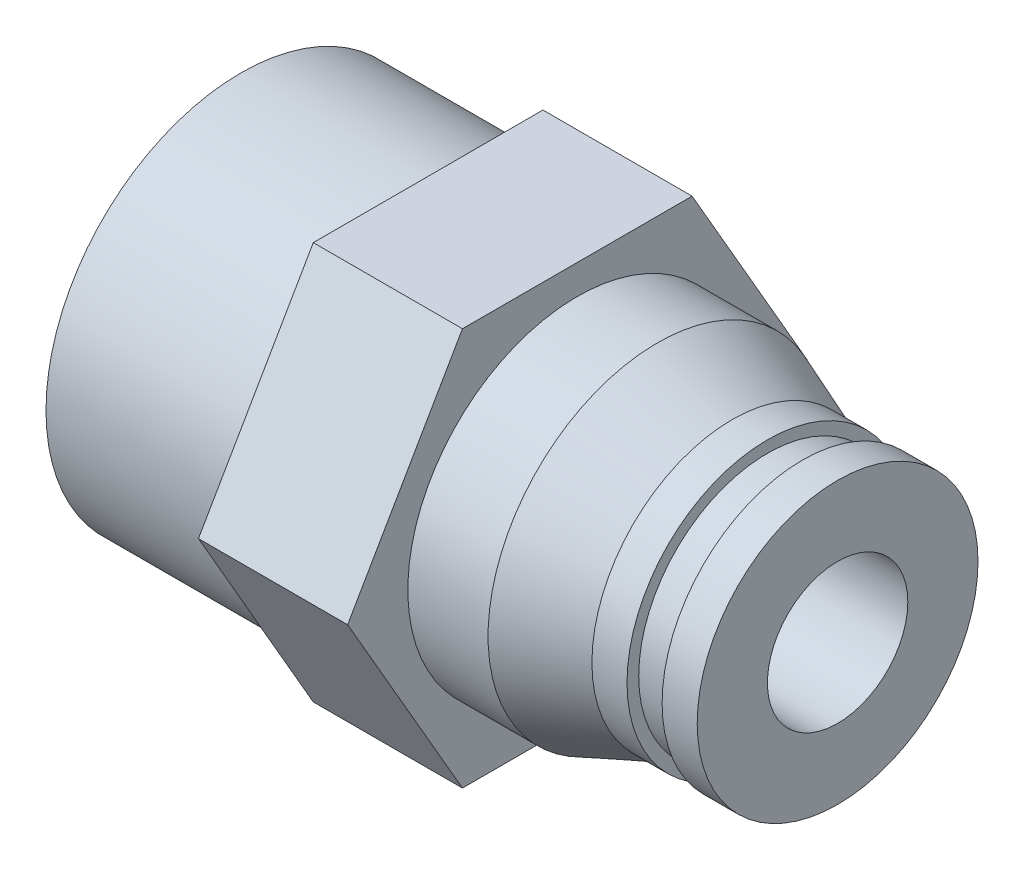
ISO-10303-21;
HEADER;
FILE_DESCRIPTION(('STEP AP214'),'2;1');
FILE_NAME('part.step','',(''),(''),'','','');
FILE_SCHEMA(('AUTOMOTIVE_DESIGN { 1 0 10303 214 1 1 1 1 }'));
ENDSEC;
DATA;
#1=APPLICATION_CONTEXT('core data for automotive mechanical design processes');
#2=APPLICATION_PROTOCOL_DEFINITION('international standard','automotive_design',2000,#1);
#3=PRODUCT_CONTEXT('',#1,'mechanical');
#4=PRODUCT('Part','Part','',(#3));
#5=PRODUCT_RELATED_PRODUCT_CATEGORY('part','',(#4));
#6=PRODUCT_DEFINITION_FORMATION('','',#4);
#7=PRODUCT_DEFINITION_CONTEXT('part definition',#1,'design');
#8=PRODUCT_DEFINITION('design','',#6,#7);
#9=PRODUCT_DEFINITION_SHAPE('','',#8);
#10=(LENGTH_UNIT() NAMED_UNIT(*) SI_UNIT(.MILLI.,.METRE.));
#11=(NAMED_UNIT(*) PLANE_ANGLE_UNIT() SI_UNIT($,.RADIAN.));
#12=(NAMED_UNIT(*) SI_UNIT($,.STERADIAN.) SOLID_ANGLE_UNIT());
#13=UNCERTAINTY_MEASURE_WITH_UNIT(LENGTH_MEASURE(1.E-05),#10,'distance_accuracy_value','');
#14=(GEOMETRIC_REPRESENTATION_CONTEXT(3) GLOBAL_UNCERTAINTY_ASSIGNED_CONTEXT((#13)) GLOBAL_UNIT_ASSIGNED_CONTEXT((#10,
#11,#12)) REPRESENTATION_CONTEXT('',''));
#15=CARTESIAN_POINT('',(0.,0.,0.));
#16=DIRECTION('',(0.,0.,1.));
#17=DIRECTION('',(1.,0.,0.));
#18=AXIS2_PLACEMENT_3D('',#15,#16,#17);
#19=CARTESIAN_POINT('',(8.,8.33,0.));
#20=DIRECTION('',(-1.,0.,0.));
#21=DIRECTION('',(0.,0.,1.));
#22=AXIS2_PLACEMENT_3D('',#19,#20,#21);
#23=PLANE('',#22);
#24=CARTESIAN_POINT('',(8.,0.,0.));
#25=DIRECTION('',(1.,0.,0.));
#26=DIRECTION('',(0.,0.,-1.));
#27=AXIS2_PLACEMENT_3D('',#24,#25,#26);
#28=CIRCLE('',#27,8.33);
#29=CARTESIAN_POINT('',(8.,0.,-8.33));
#30=VERTEX_POINT('',#29);
#31=EDGE_CURVE('E215',#30,#30,#28,.T.);
#32=ORIENTED_EDGE('',*,*,#31,.T.);
#33=EDGE_LOOP('',(#32));
#34=FACE_BOUND('',#33,.T.);
#35=DIRECTION('',(0.,-0.866025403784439,0.5));
#36=VECTOR('',#35,1.);
#37=CARTESIAN_POINT('',(8.,0.,-9.81495457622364));
#38=LINE('',#37,#36);
#39=CARTESIAN_POINT('',(8.,0.,-9.81495457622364));
#40=VERTEX_POINT('',#39);
#41=CARTESIAN_POINT('',(8.,-8.5,-4.90747728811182));
#42=VERTEX_POINT('',#41);
#43=EDGE_CURVE('E121',#40,#42,#38,.T.);
#44=ORIENTED_EDGE('',*,*,#43,.T.);
#45=DIRECTION('',(0.,0.,1.));
#46=VECTOR('',#45,1.);
#47=CARTESIAN_POINT('',(8.,-8.5,-4.90747728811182));
#48=LINE('',#47,#46);
#49=CARTESIAN_POINT('',(8.,-8.5,4.90747728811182));
#50=VERTEX_POINT('',#49);
#51=EDGE_CURVE('E106',#42,#50,#48,.T.);
#52=ORIENTED_EDGE('',*,*,#51,.T.);
#53=DIRECTION('',(0.,0.866025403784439,0.5));
#54=VECTOR('',#53,1.);
#55=CARTESIAN_POINT('',(8.,-8.5,4.90747728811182));
#56=LINE('',#55,#54);
#57=CARTESIAN_POINT('',(8.,0.,9.81495457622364));
#58=VERTEX_POINT('',#57);
#59=EDGE_CURVE('E115',#50,#58,#56,.T.);
#60=ORIENTED_EDGE('',*,*,#59,.T.);
#61=DIRECTION('',(0.,0.866025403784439,-0.5));
#62=VECTOR('',#61,1.);
#63=CARTESIAN_POINT('',(8.,0.,9.81495457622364));
#64=LINE('',#63,#62);
#65=CARTESIAN_POINT('',(8.,8.5,4.90747728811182));
#66=VERTEX_POINT('',#65);
#67=EDGE_CURVE('E30',#58,#66,#64,.T.);
#68=ORIENTED_EDGE('',*,*,#67,.T.);
#69=DIRECTION('',(0.,0.,-1.));
#70=VECTOR('',#69,1.);
#71=CARTESIAN_POINT('',(8.,8.5,4.90747728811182));
#72=LINE('',#71,#70);
#73=CARTESIAN_POINT('',(8.,8.5,-4.90747728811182));
#74=VERTEX_POINT('',#73);
#75=EDGE_CURVE('E125',#66,#74,#72,.T.);
#76=ORIENTED_EDGE('',*,*,#75,.T.);
#77=DIRECTION('',(0.,-0.866025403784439,-0.5));
#78=VECTOR('',#77,1.);
#79=CARTESIAN_POINT('',(8.,8.5,-4.90747728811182));
#80=LINE('',#79,#78);
#81=EDGE_CURVE('E128',#74,#40,#80,.T.);
#82=ORIENTED_EDGE('',*,*,#81,.T.);
#83=EDGE_LOOP('',(#44,#52,#60,#68,#76,#82));
#84=FACE_BOUND('',#83,.T.);
#85=ADVANCED_FACE('F15',(#34,#84),#23,.T.);
#86=CARTESIAN_POINT('',(14.375,10.5,0.));
#87=DIRECTION('',(1.,0.,0.));
#88=DIRECTION('',(0.,0.,-1.));
#89=AXIS2_PLACEMENT_3D('',#86,#87,#88);
#90=PLANE('',#89);
#91=CARTESIAN_POINT('',(14.375,0.,0.));
#92=DIRECTION('',(1.,0.,0.));
#93=DIRECTION('',(0.,0.,-1.));
#94=AXIS2_PLACEMENT_3D('',#91,#92,#93);
#95=CIRCLE('',#94,7.24152932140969);
#96=CARTESIAN_POINT('',(14.375,0.,-7.24152932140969));
#97=VERTEX_POINT('',#96);
#98=EDGE_CURVE('E212',#97,#97,#95,.T.);
#99=ORIENTED_EDGE('',*,*,#98,.F.);
#100=EDGE_LOOP('',(#99));
#101=FACE_BOUND('',#100,.T.);
#102=DIRECTION('',(0.,0.866025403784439,0.5));
#103=VECTOR('',#102,1.);
#104=CARTESIAN_POINT('',(14.375,-8.5,4.90747728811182));
#105=LINE('',#104,#103);
#106=CARTESIAN_POINT('',(14.375,-8.5,4.90747728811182));
#107=VERTEX_POINT('',#106);
#108=CARTESIAN_POINT('',(14.375,0.,9.81495457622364));
#109=VERTEX_POINT('',#108);
#110=EDGE_CURVE('E132',#107,#109,#105,.T.);
#111=ORIENTED_EDGE('',*,*,#110,.F.);
#112=DIRECTION('',(0.,0.,1.));
#113=VECTOR('',#112,1.);
#114=CARTESIAN_POINT('',(14.375,-8.5,-4.90747728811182));
#115=LINE('',#114,#113);
#116=CARTESIAN_POINT('',(14.375,-8.5,-4.90747728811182));
#117=VERTEX_POINT('',#116);
#118=EDGE_CURVE('E38',#117,#107,#115,.T.);
#119=ORIENTED_EDGE('',*,*,#118,.F.);
#120=DIRECTION('',(0.,-0.866025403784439,0.5));
#121=VECTOR('',#120,1.);
#122=CARTESIAN_POINT('',(14.375,0.,-9.81495457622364));
#123=LINE('',#122,#121);
#124=CARTESIAN_POINT('',(14.375,0.,-9.81495457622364));
#125=VERTEX_POINT('',#124);
#126=EDGE_CURVE('E112',#125,#117,#123,.T.);
#127=ORIENTED_EDGE('',*,*,#126,.F.);
#128=DIRECTION('',(0.,-0.866025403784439,-0.5));
#129=VECTOR('',#128,1.);
#130=CARTESIAN_POINT('',(14.375,8.5,-4.90747728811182));
#131=LINE('',#130,#129);
#132=CARTESIAN_POINT('',(14.375,8.5,-4.90747728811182));
#133=VERTEX_POINT('',#132);
#134=EDGE_CURVE('E140',#133,#125,#131,.T.);
#135=ORIENTED_EDGE('',*,*,#134,.F.);
#136=DIRECTION('',(0.,0.,-1.));
#137=VECTOR('',#136,1.);
#138=CARTESIAN_POINT('',(14.375,8.5,4.90747728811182));
#139=LINE('',#138,#137);
#140=CARTESIAN_POINT('',(14.375,8.5,4.90747728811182));
#141=VERTEX_POINT('',#140);
#142=EDGE_CURVE('E137',#141,#133,#139,.T.);
#143=ORIENTED_EDGE('',*,*,#142,.F.);
#144=DIRECTION('',(0.,0.866025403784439,-0.5));
#145=VECTOR('',#144,1.);
#146=CARTESIAN_POINT('',(14.375,0.,9.81495457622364));
#147=LINE('',#146,#145);
#148=EDGE_CURVE('E134',#109,#141,#147,.T.);
#149=ORIENTED_EDGE('',*,*,#148,.F.);
#150=EDGE_LOOP('',(#111,#119,#127,#135,#143,#149));
#151=FACE_BOUND('',#150,.T.);
#152=ADVANCED_FACE('F269',(#101,#151),#90,.T.);
#153=CARTESIAN_POINT('',(0.,0.,0.));
#154=DIRECTION('',(-1.,0.,0.));
#155=DIRECTION('',(0.,0.,1.));
#156=AXIS2_PLACEMENT_3D('',#153,#154,#155);
#157=PLANE('',#156);
#158=CARTESIAN_POINT('',(0.,0.,0.));
#159=DIRECTION('',(1.,0.,0.));
#160=DIRECTION('',(0.,0.,-1.));
#161=AXIS2_PLACEMENT_3D('',#158,#159,#160);
#162=CIRCLE('',#161,8.33);
#163=CARTESIAN_POINT('',(0.,0.,-8.33));
#164=VERTEX_POINT('',#163);
#165=EDGE_CURVE('E218',#164,#164,#162,.T.);
#166=ORIENTED_EDGE('',*,*,#165,.F.);
#167=EDGE_LOOP('',(#166));
#168=FACE_BOUND('',#167,.T.);
#169=DIRECTION('',(0.,-0.866025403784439,-0.5));
#170=VECTOR('',#169,1.);
#171=CARTESIAN_POINT('',(0.,0.,2.88675134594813));
#172=LINE('',#171,#170);
#173=CARTESIAN_POINT('',(0.,0.,2.88675134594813));
#174=VERTEX_POINT('',#173);
#175=CARTESIAN_POINT('',(0.,-2.5,1.44337567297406));
#176=VERTEX_POINT('',#175);
#177=EDGE_CURVE('E169',#174,#176,#172,.T.);
#178=ORIENTED_EDGE('',*,*,#177,.T.);
#179=DIRECTION('',(0.,0.,-1.));
#180=VECTOR('',#179,1.);
#181=CARTESIAN_POINT('',(0.,-2.5,1.44337567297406));
#182=LINE('',#181,#180);
#183=CARTESIAN_POINT('',(0.,-2.5,-1.44337567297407));
#184=VERTEX_POINT('',#183);
#185=EDGE_CURVE('E147',#176,#184,#182,.T.);
#186=ORIENTED_EDGE('',*,*,#185,.T.);
#187=DIRECTION('',(0.,0.866025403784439,-0.5));
#188=VECTOR('',#187,1.);
#189=CARTESIAN_POINT('',(0.,-2.5,-1.44337567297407));
#190=LINE('',#189,#188);
#191=CARTESIAN_POINT('',(0.,0.,-2.88675134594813));
#192=VERTEX_POINT('',#191);
#193=EDGE_CURVE('E157',#184,#192,#190,.T.);
#194=ORIENTED_EDGE('',*,*,#193,.T.);
#195=DIRECTION('',(0.,0.866025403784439,0.5));
#196=VECTOR('',#195,1.);
#197=CARTESIAN_POINT('',(0.,0.,-2.88675134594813));
#198=LINE('',#197,#196);
#199=CARTESIAN_POINT('',(0.,2.5,-1.44337567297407));
#200=VERTEX_POINT('',#199);
#201=EDGE_CURVE('E160',#192,#200,#198,.T.);
#202=ORIENTED_EDGE('',*,*,#201,.T.);
#203=DIRECTION('',(0.,0.,1.));
#204=VECTOR('',#203,1.);
#205=CARTESIAN_POINT('',(0.,2.5,-1.44337567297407));
#206=LINE('',#205,#204);
#207=CARTESIAN_POINT('',(0.,2.5,1.44337567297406));
#208=VERTEX_POINT('',#207);
#209=EDGE_CURVE('E163',#200,#208,#206,.T.);
#210=ORIENTED_EDGE('',*,*,#209,.T.);
#211=DIRECTION('',(0.,-0.866025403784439,0.5));
#212=VECTOR('',#211,1.);
#213=CARTESIAN_POINT('',(0.,2.5,1.44337567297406));
#214=LINE('',#213,#212);
#215=EDGE_CURVE('E166',#208,#174,#214,.T.);
#216=ORIENTED_EDGE('',*,*,#215,.T.);
#217=EDGE_LOOP('',(#178,#186,#194,#202,#210,#216));
#218=FACE_BOUND('',#217,.T.);
#219=ADVANCED_FACE('F17',(#168,#218),#157,.T.);
#220=CARTESIAN_POINT('',(9.,3.,0.));
#221=DIRECTION('',(1.,0.,0.));
#222=DIRECTION('',(0.,0.,-1.));
#223=AXIS2_PLACEMENT_3D('',#220,#221,#222);
#224=PLANE('',#223);
#225=CARTESIAN_POINT('',(9.,0.,0.));
#226=DIRECTION('',(1.,0.,0.));
#227=DIRECTION('',(0.,0.,-1.));
#228=AXIS2_PLACEMENT_3D('',#225,#226,#227);
#229=CIRCLE('',#228,3.);
#230=CARTESIAN_POINT('',(9.,0.,-3.));
#231=VERTEX_POINT('',#230);
#232=EDGE_CURVE('E185',#231,#231,#229,.T.);
#233=ORIENTED_EDGE('',*,*,#232,.T.);
#234=EDGE_LOOP('',(#233));
#235=FACE_BOUND('',#234,.T.);
#236=DIRECTION('',(0.,-0.866025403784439,0.5));
#237=VECTOR('',#236,1.);
#238=CARTESIAN_POINT('',(9.,1.,-3.46410161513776));
#239=LINE('',#238,#237);
#240=CARTESIAN_POINT('',(9.,0.,-2.88675134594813));
#241=VERTEX_POINT('',#240);
#242=CARTESIAN_POINT('',(9.,-2.5,-1.44337567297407));
#243=VERTEX_POINT('',#242);
#244=EDGE_CURVE('E23',#241,#243,#239,.T.);
#245=ORIENTED_EDGE('',*,*,#244,.T.);
#246=DIRECTION('',(0.,0.,1.));
#247=VECTOR('',#246,1.);
#248=CARTESIAN_POINT('',(9.,-2.5,0.));
#249=LINE('',#248,#247);
#250=CARTESIAN_POINT('',(9.,-2.5,1.44337567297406));
#251=VERTEX_POINT('',#250);
#252=EDGE_CURVE('E9',#243,#251,#249,.T.);
#253=ORIENTED_EDGE('',*,*,#252,.T.);
#254=DIRECTION('',(0.,0.866025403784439,0.5));
#255=VECTOR('',#254,1.);
#256=CARTESIAN_POINT('',(9.,1.,3.46410161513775));
#257=LINE('',#256,#255);
#258=CARTESIAN_POINT('',(9.,0.,2.88675134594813));
#259=VERTEX_POINT('',#258);
#260=EDGE_CURVE('E221',#251,#259,#257,.T.);
#261=ORIENTED_EDGE('',*,*,#260,.T.);
#262=DIRECTION('',(0.,0.866025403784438,-0.5));
#263=VECTOR('',#262,1.);
#264=CARTESIAN_POINT('',(9.,3.5,0.866025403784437));
#265=LINE('',#264,#263);
#266=CARTESIAN_POINT('',(9.,2.5,1.44337567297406));
#267=VERTEX_POINT('',#266);
#268=EDGE_CURVE('E224',#259,#267,#265,.T.);
#269=ORIENTED_EDGE('',*,*,#268,.T.);
#270=DIRECTION('',(0.,0.,-1.));
#271=VECTOR('',#270,1.);
#272=CARTESIAN_POINT('',(9.,2.5,0.));
#273=LINE('',#272,#271);
#274=CARTESIAN_POINT('',(9.,2.5,-1.44337567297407));
#275=VERTEX_POINT('',#274);
#276=EDGE_CURVE('E227',#267,#275,#273,.T.);
#277=ORIENTED_EDGE('',*,*,#276,.T.);
#278=DIRECTION('',(0.,-0.866025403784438,-0.5));
#279=VECTOR('',#278,1.);
#280=CARTESIAN_POINT('',(9.,3.5,-0.866025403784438));
#281=LINE('',#280,#279);
#282=EDGE_CURVE('E230',#275,#241,#281,.T.);
#283=ORIENTED_EDGE('',*,*,#282,.T.);
#284=EDGE_LOOP('',(#245,#253,#261,#269,#277,#283));
#285=FACE_BOUND('',#284,.T.);
#286=ADVANCED_FACE('F234',(#235,#285),#224,.T.);
#287=CARTESIAN_POINT('',(0.,0.,0.));
#288=DIRECTION('',(1.,0.,0.));
#289=DIRECTION('',(0.,0.,-1.));
#290=AXIS2_PLACEMENT_3D('',#287,#288,#289);
#291=CYLINDRICAL_SURFACE('',#290,8.33);
#292=ORIENTED_EDGE('',*,*,#165,.T.);
#293=EDGE_LOOP('',(#292));
#294=FACE_BOUND('',#293,.T.);
#295=ORIENTED_EDGE('',*,*,#31,.F.);
#296=EDGE_LOOP('',(#295));
#297=FACE_BOUND('',#296,.T.);
#298=ADVANCED_FACE('F278',(#294,#297),#291,.T.);
#299=CARTESIAN_POINT('',(0.,0.,0.));
#300=DIRECTION('',(1.,0.,0.));
#301=DIRECTION('',(0.,0.,-1.));
#302=AXIS2_PLACEMENT_3D('',#299,#300,#301);
#303=CYLINDRICAL_SURFACE('',#302,7.24152932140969);
#304=ORIENTED_EDGE('',*,*,#98,.T.);
#305=EDGE_LOOP('',(#304));
#306=FACE_BOUND('',#305,.T.);
#307=CARTESIAN_POINT('',(17.8038317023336,0.,0.));
#308=DIRECTION('',(1.,0.,0.));
#309=DIRECTION('',(0.,0.,-1.));
#310=AXIS2_PLACEMENT_3D('',#307,#308,#309);
#311=CIRCLE('',#310,7.24152932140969);
#312=CARTESIAN_POINT('',(17.8038317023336,0.,-7.24152932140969));
#313=VERTEX_POINT('',#312);
#314=EDGE_CURVE('E209',#313,#313,#311,.T.);
#315=ORIENTED_EDGE('',*,*,#314,.F.);
#316=EDGE_LOOP('',(#315));
#317=FACE_BOUND('',#316,.T.);
#318=ADVANCED_FACE('F280',(#306,#317),#303,.T.);
#319=CARTESIAN_POINT('',(21.,0.,0.));
#320=DIRECTION('',(-1.,0.,0.));
#321=DIRECTION('',(0.,0.,1.));
#322=AXIS2_PLACEMENT_3D('',#319,#320,#321);
#323=CONICAL_SURFACE('',#322,6.,0.370503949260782);
#324=ORIENTED_EDGE('',*,*,#314,.T.);
#325=EDGE_LOOP('',(#324));
#326=FACE_BOUND('',#325,.T.);
#327=CARTESIAN_POINT('',(21.,0.,0.));
#328=DIRECTION('',(1.,0.,0.));
#329=DIRECTION('',(0.,0.,-1.));
#330=AXIS2_PLACEMENT_3D('',#327,#328,#329);
#331=CIRCLE('',#330,6.);
#332=CARTESIAN_POINT('',(21.,0.,-6.));
#333=VERTEX_POINT('',#332);
#334=EDGE_CURVE('E206',#333,#333,#331,.T.);
#335=ORIENTED_EDGE('',*,*,#334,.F.);
#336=EDGE_LOOP('',(#335));
#337=FACE_BOUND('',#336,.T.);
#338=ADVANCED_FACE('F286',(#326,#337),#323,.T.);
#339=CARTESIAN_POINT('',(0.,0.,0.));
#340=DIRECTION('',(1.,0.,0.));
#341=DIRECTION('',(0.,0.,-1.));
#342=AXIS2_PLACEMENT_3D('',#339,#340,#341);
#343=CYLINDRICAL_SURFACE('',#342,6.);
#344=ORIENTED_EDGE('',*,*,#334,.T.);
#345=EDGE_LOOP('',(#344));
#346=FACE_BOUND('',#345,.T.);
#347=CARTESIAN_POINT('',(22.5,0.,0.));
#348=DIRECTION('',(1.,0.,0.));
#349=DIRECTION('',(0.,0.,-1.));
#350=AXIS2_PLACEMENT_3D('',#347,#348,#349);
#351=CIRCLE('',#350,6.);
#352=CARTESIAN_POINT('',(22.5,0.,-6.));
#353=VERTEX_POINT('',#352);
#354=EDGE_CURVE('E203',#353,#353,#351,.T.);
#355=ORIENTED_EDGE('',*,*,#354,.F.);
#356=EDGE_LOOP('',(#355));
#357=FACE_BOUND('',#356,.T.);
#358=ADVANCED_FACE('F330',(#346,#357),#343,.T.);
#359=CARTESIAN_POINT('',(22.5,6.,0.));
#360=DIRECTION('',(1.,0.,0.));
#361=DIRECTION('',(0.,0.,-1.));
#362=AXIS2_PLACEMENT_3D('',#359,#360,#361);
#363=PLANE('',#362);
#364=ORIENTED_EDGE('',*,*,#354,.T.);
#365=EDGE_LOOP('',(#364));
#366=FACE_BOUND('',#365,.T.);
#367=CARTESIAN_POINT('',(22.5,0.,0.));
#368=DIRECTION('',(1.,0.,0.));
#369=DIRECTION('',(0.,0.,-1.));
#370=AXIS2_PLACEMENT_3D('',#367,#368,#369);
#371=CIRCLE('',#370,5.5);
#372=CARTESIAN_POINT('',(22.5,0.,-5.5));
#373=VERTEX_POINT('',#372);
#374=EDGE_CURVE('E200',#373,#373,#371,.T.);
#375=ORIENTED_EDGE('',*,*,#374,.F.);
#376=EDGE_LOOP('',(#375));
#377=FACE_BOUND('',#376,.T.);
#378=ADVANCED_FACE('F340',(#366,#377),#363,.T.);
#379=CARTESIAN_POINT('',(0.,0.,0.));
#380=DIRECTION('',(1.,0.,0.));
#381=DIRECTION('',(0.,0.,-1.));
#382=AXIS2_PLACEMENT_3D('',#379,#380,#381);
#383=CYLINDRICAL_SURFACE('',#382,5.5);
#384=ORIENTED_EDGE('',*,*,#374,.T.);
#385=EDGE_LOOP('',(#384));
#386=FACE_BOUND('',#385,.T.);
#387=CARTESIAN_POINT('',(24.,0.,0.));
#388=DIRECTION('',(1.,0.,0.));
#389=DIRECTION('',(0.,0.,-1.));
#390=AXIS2_PLACEMENT_3D('',#387,#388,#389);
#391=CIRCLE('',#390,5.5);
#392=CARTESIAN_POINT('',(24.,0.,-5.5));
#393=VERTEX_POINT('',#392);
#394=EDGE_CURVE('E197',#393,#393,#391,.T.);
#395=ORIENTED_EDGE('',*,*,#394,.F.);
#396=EDGE_LOOP('',(#395));
#397=FACE_BOUND('',#396,.T.);
#398=ADVANCED_FACE('F350',(#386,#397),#383,.T.);
#399=CARTESIAN_POINT('',(24.,5.5,0.));
#400=DIRECTION('',(-1.,0.,0.));
#401=DIRECTION('',(0.,0.,1.));
#402=AXIS2_PLACEMENT_3D('',#399,#400,#401);
#403=PLANE('',#402);
#404=ORIENTED_EDGE('',*,*,#394,.T.);
#405=EDGE_LOOP('',(#404));
#406=FACE_BOUND('',#405,.T.);
#407=CARTESIAN_POINT('',(24.,0.,0.));
#408=DIRECTION('',(1.,0.,0.));
#409=DIRECTION('',(0.,0.,-1.));
#410=AXIS2_PLACEMENT_3D('',#407,#408,#409);
#411=CIRCLE('',#410,6.);
#412=CARTESIAN_POINT('',(24.,0.,-6.));
#413=VERTEX_POINT('',#412);
#414=EDGE_CURVE('E194',#413,#413,#411,.T.);
#415=ORIENTED_EDGE('',*,*,#414,.F.);
#416=EDGE_LOOP('',(#415));
#417=FACE_BOUND('',#416,.T.);
#418=ADVANCED_FACE('F361',(#406,#417),#403,.T.);
#419=CARTESIAN_POINT('',(0.,0.,0.));
#420=DIRECTION('',(1.,0.,0.));
#421=DIRECTION('',(0.,0.,-1.));
#422=AXIS2_PLACEMENT_3D('',#419,#420,#421);
#423=CYLINDRICAL_SURFACE('',#422,6.);
#424=ORIENTED_EDGE('',*,*,#414,.T.);
#425=EDGE_LOOP('',(#424));
#426=FACE_BOUND('',#425,.T.);
#427=CARTESIAN_POINT('',(25.5,0.,0.));
#428=DIRECTION('',(1.,0.,0.));
#429=DIRECTION('',(0.,0.,-1.));
#430=AXIS2_PLACEMENT_3D('',#427,#428,#429);
#431=CIRCLE('',#430,6.);
#432=CARTESIAN_POINT('',(25.5,0.,-6.));
#433=VERTEX_POINT('',#432);
#434=EDGE_CURVE('E191',#433,#433,#431,.T.);
#435=ORIENTED_EDGE('',*,*,#434,.F.);
#436=EDGE_LOOP('',(#435));
#437=FACE_BOUND('',#436,.T.);
#438=ADVANCED_FACE('F374',(#426,#437),#423,.T.);
#439=CARTESIAN_POINT('',(25.5,6.,0.));
#440=DIRECTION('',(1.,0.,0.));
#441=DIRECTION('',(0.,0.,-1.));
#442=AXIS2_PLACEMENT_3D('',#439,#440,#441);
#443=PLANE('',#442);
#444=ORIENTED_EDGE('',*,*,#434,.T.);
#445=EDGE_LOOP('',(#444));
#446=FACE_BOUND('',#445,.T.);
#447=CARTESIAN_POINT('',(25.5,0.,0.));
#448=DIRECTION('',(1.,0.,0.));
#449=DIRECTION('',(0.,0.,-1.));
#450=AXIS2_PLACEMENT_3D('',#447,#448,#449);
#451=CIRCLE('',#450,3.);
#452=CARTESIAN_POINT('',(25.5,0.,-3.));
#453=VERTEX_POINT('',#452);
#454=EDGE_CURVE('E188',#453,#453,#451,.T.);
#455=ORIENTED_EDGE('',*,*,#454,.F.);
#456=EDGE_LOOP('',(#455));
#457=FACE_BOUND('',#456,.T.);
#458=ADVANCED_FACE('F384',(#446,#457),#443,.T.);
#459=CARTESIAN_POINT('',(0.,0.,0.));
#460=DIRECTION('',(1.,0.,0.));
#461=DIRECTION('',(0.,0.,-1.));
#462=AXIS2_PLACEMENT_3D('',#459,#460,#461);
#463=CYLINDRICAL_SURFACE('',#462,3.);
#464=ORIENTED_EDGE('',*,*,#454,.T.);
#465=EDGE_LOOP('',(#464));
#466=FACE_BOUND('',#465,.T.);
#467=ORIENTED_EDGE('',*,*,#232,.F.);
#468=EDGE_LOOP('',(#467));
#469=FACE_BOUND('',#468,.T.);
#470=ADVANCED_FACE('F396',(#466,#469),#463,.F.);
#471=CARTESIAN_POINT('',(25.5,-2.5,1.44337567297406));
#472=DIRECTION('',(0.,1.,0.));
#473=DIRECTION('',(0.,0.,1.));
#474=AXIS2_PLACEMENT_3D('',#471,#472,#473);
#475=PLANE('',#474);
#476=DIRECTION('',(-1.,0.,0.));
#477=VECTOR('',#476,1.);
#478=CARTESIAN_POINT('',(25.5,-2.5,-1.44337567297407));
#479=LINE('',#478,#477);
#480=EDGE_CURVE('E183',#243,#184,#479,.T.);
#481=ORIENTED_EDGE('',*,*,#480,.T.);
#482=ORIENTED_EDGE('',*,*,#185,.F.);
#483=DIRECTION('',(-1.,0.,0.));
#484=VECTOR('',#483,1.);
#485=CARTESIAN_POINT('',(25.5,-2.5,1.44337567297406));
#486=LINE('',#485,#484);
#487=EDGE_CURVE('E172',#251,#176,#486,.T.);
#488=ORIENTED_EDGE('',*,*,#487,.F.);
#489=ORIENTED_EDGE('',*,*,#252,.F.);
#490=EDGE_LOOP('',(#481,#482,#488,#489));
#491=FACE_BOUND('',#490,.T.);
#492=ADVANCED_FACE('F249',(#491),#475,.T.);
#493=CARTESIAN_POINT('',(25.5,-2.5,-1.44337567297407));
#494=DIRECTION('',(0.,0.5,0.866025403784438));
#495=DIRECTION('',(0.,-0.866025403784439,0.5));
#496=AXIS2_PLACEMENT_3D('',#493,#494,#495);
#497=PLANE('',#496);
#498=DIRECTION('',(-1.,0.,0.));
#499=VECTOR('',#498,1.);
#500=CARTESIAN_POINT('',(25.5,0.,-2.88675134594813));
#501=LINE('',#500,#499);
#502=EDGE_CURVE('E181',#241,#192,#501,.T.);
#503=ORIENTED_EDGE('',*,*,#502,.T.);
#504=ORIENTED_EDGE('',*,*,#193,.F.);
#505=ORIENTED_EDGE('',*,*,#480,.F.);
#506=ORIENTED_EDGE('',*,*,#244,.F.);
#507=EDGE_LOOP('',(#503,#504,#505,#506));
#508=FACE_BOUND('',#507,.T.);
#509=ADVANCED_FACE('F238',(#508),#497,.T.);
#510=CARTESIAN_POINT('',(25.5,0.,-2.88675134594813));
#511=DIRECTION('',(0.,-0.5,0.866025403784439));
#512=DIRECTION('',(0.,-0.866025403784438,-0.5));
#513=AXIS2_PLACEMENT_3D('',#510,#511,#512);
#514=PLANE('',#513);
#515=DIRECTION('',(-1.,0.,0.));
#516=VECTOR('',#515,1.);
#517=CARTESIAN_POINT('',(25.5,2.5,-1.44337567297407));
#518=LINE('',#517,#516);
#519=EDGE_CURVE('E179',#275,#200,#518,.T.);
#520=ORIENTED_EDGE('',*,*,#519,.T.);
#521=ORIENTED_EDGE('',*,*,#201,.F.);
#522=ORIENTED_EDGE('',*,*,#502,.F.);
#523=ORIENTED_EDGE('',*,*,#282,.F.);
#524=EDGE_LOOP('',(#520,#521,#522,#523));
#525=FACE_BOUND('',#524,.T.);
#526=ADVANCED_FACE('F242',(#525),#514,.T.);
#527=CARTESIAN_POINT('',(25.5,2.5,-1.44337567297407));
#528=DIRECTION('',(0.,-1.,0.));
#529=DIRECTION('',(0.,0.,-1.));
#530=AXIS2_PLACEMENT_3D('',#527,#528,#529);
#531=PLANE('',#530);
#532=DIRECTION('',(-1.,0.,0.));
#533=VECTOR('',#532,1.);
#534=CARTESIAN_POINT('',(25.5,2.5,1.44337567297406));
#535=LINE('',#534,#533);
#536=EDGE_CURVE('E177',#267,#208,#535,.T.);
#537=ORIENTED_EDGE('',*,*,#536,.T.);
#538=ORIENTED_EDGE('',*,*,#209,.F.);
#539=ORIENTED_EDGE('',*,*,#519,.F.);
#540=ORIENTED_EDGE('',*,*,#276,.F.);
#541=EDGE_LOOP('',(#537,#538,#539,#540));
#542=FACE_BOUND('',#541,.T.);
#543=ADVANCED_FACE('F258',(#542),#531,.T.);
#544=CARTESIAN_POINT('',(25.5,2.5,1.44337567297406));
#545=DIRECTION('',(0.,-0.5,-0.866025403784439));
#546=DIRECTION('',(0.,0.866025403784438,-0.5));
#547=AXIS2_PLACEMENT_3D('',#544,#545,#546);
#548=PLANE('',#547);
#549=DIRECTION('',(-1.,0.,0.));
#550=VECTOR('',#549,1.);
#551=CARTESIAN_POINT('',(25.5,0.,2.88675134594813));
#552=LINE('',#551,#550);
#553=EDGE_CURVE('E175',#259,#174,#552,.T.);
#554=ORIENTED_EDGE('',*,*,#553,.T.);
#555=ORIENTED_EDGE('',*,*,#215,.F.);
#556=ORIENTED_EDGE('',*,*,#536,.F.);
#557=ORIENTED_EDGE('',*,*,#268,.F.);
#558=EDGE_LOOP('',(#554,#555,#556,#557));
#559=FACE_BOUND('',#558,.T.);
#560=ADVANCED_FACE('F255',(#559),#548,.T.);
#561=CARTESIAN_POINT('',(25.5,0.,2.88675134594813));
#562=DIRECTION('',(0.,0.5,-0.866025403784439));
#563=DIRECTION('',(0.,0.866025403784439,0.5));
#564=AXIS2_PLACEMENT_3D('',#561,#562,#563);
#565=PLANE('',#564);
#566=ORIENTED_EDGE('',*,*,#487,.T.);
#567=ORIENTED_EDGE('',*,*,#177,.F.);
#568=ORIENTED_EDGE('',*,*,#553,.F.);
#569=ORIENTED_EDGE('',*,*,#260,.F.);
#570=EDGE_LOOP('',(#566,#567,#568,#569));
#571=FACE_BOUND('',#570,.T.);
#572=ADVANCED_FACE('F251',(#571),#565,.T.);
#573=CARTESIAN_POINT('',(14.375,-8.5,-4.90747728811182));
#574=DIRECTION('',(0.,-1.,0.));
#575=DIRECTION('',(0.,0.,-1.));
#576=AXIS2_PLACEMENT_3D('',#573,#574,#575);
#577=PLANE('',#576);
#578=DIRECTION('',(-1.,0.,0.));
#579=VECTOR('',#578,1.);
#580=CARTESIAN_POINT('',(14.375,-8.5,-4.90747728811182));
#581=LINE('',#580,#579);
#582=EDGE_CURVE('E145',#117,#42,#581,.T.);
#583=ORIENTED_EDGE('',*,*,#582,.F.);
#584=ORIENTED_EDGE('',*,*,#118,.T.);
#585=DIRECTION('',(-1.,0.,0.));
#586=VECTOR('',#585,1.);
#587=CARTESIAN_POINT('',(14.375,-8.5,4.90747728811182));
#588=LINE('',#587,#586);
#589=EDGE_CURVE('E102',#107,#50,#588,.T.);
#590=ORIENTED_EDGE('',*,*,#589,.T.);
#591=ORIENTED_EDGE('',*,*,#51,.F.);
#592=EDGE_LOOP('',(#583,#584,#590,#591));
#593=FACE_BOUND('',#592,.T.);
#594=ADVANCED_FACE('F104',(#593),#577,.T.);
#595=CARTESIAN_POINT('',(14.375,0.,-9.81495457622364));
#596=DIRECTION('',(0.,-0.5,-0.866025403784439));
#597=DIRECTION('',(0.,0.866025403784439,-0.5));
#598=AXIS2_PLACEMENT_3D('',#595,#596,#597);
#599=PLANE('',#598);
#600=DIRECTION('',(-1.,0.,0.));
#601=VECTOR('',#600,1.);
#602=CARTESIAN_POINT('',(14.375,0.,-9.81495457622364));
#603=LINE('',#602,#601);
#604=EDGE_CURVE('E148',#125,#40,#603,.T.);
#605=ORIENTED_EDGE('',*,*,#604,.F.);
#606=ORIENTED_EDGE('',*,*,#126,.T.);
#607=ORIENTED_EDGE('',*,*,#582,.T.);
#608=ORIENTED_EDGE('',*,*,#43,.F.);
#609=EDGE_LOOP('',(#605,#606,#607,#608));
#610=FACE_BOUND('',#609,.T.);
#611=ADVANCED_FACE('F457',(#610),#599,.T.);
#612=CARTESIAN_POINT('',(14.375,8.5,-4.90747728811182));
#613=DIRECTION('',(0.,0.5,-0.866025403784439));
#614=DIRECTION('',(0.,0.866025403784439,0.5));
#615=AXIS2_PLACEMENT_3D('',#612,#613,#614);
#616=PLANE('',#615);
#617=DIRECTION('',(-1.,0.,0.));
#618=VECTOR('',#617,1.);
#619=CARTESIAN_POINT('',(14.375,8.5,-4.90747728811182));
#620=LINE('',#619,#618);
#621=EDGE_CURVE('E150',#133,#74,#620,.T.);
#622=ORIENTED_EDGE('',*,*,#621,.F.);
#623=ORIENTED_EDGE('',*,*,#134,.T.);
#624=ORIENTED_EDGE('',*,*,#604,.T.);
#625=ORIENTED_EDGE('',*,*,#81,.F.);
#626=EDGE_LOOP('',(#622,#623,#624,#625));
#627=FACE_BOUND('',#626,.T.);
#628=ADVANCED_FACE('F466',(#627),#616,.T.);
#629=CARTESIAN_POINT('',(14.375,8.5,4.90747728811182));
#630=DIRECTION('',(0.,1.,0.));
#631=DIRECTION('',(0.,0.,1.));
#632=AXIS2_PLACEMENT_3D('',#629,#630,#631);
#633=PLANE('',#632);
#634=DIRECTION('',(-1.,0.,0.));
#635=VECTOR('',#634,1.);
#636=CARTESIAN_POINT('',(14.375,8.5,4.90747728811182));
#637=LINE('',#636,#635);
#638=EDGE_CURVE('E152',#141,#66,#637,.T.);
#639=ORIENTED_EDGE('',*,*,#638,.F.);
#640=ORIENTED_EDGE('',*,*,#142,.T.);
#641=ORIENTED_EDGE('',*,*,#621,.T.);
#642=ORIENTED_EDGE('',*,*,#75,.F.);
#643=EDGE_LOOP('',(#639,#640,#641,#642));
#644=FACE_BOUND('',#643,.T.);
#645=ADVANCED_FACE('F476',(#644),#633,.T.);
#646=CARTESIAN_POINT('',(14.375,0.,9.81495457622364));
#647=DIRECTION('',(0.,0.5,0.866025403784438));
#648=DIRECTION('',(0.,-0.866025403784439,0.5));
#649=AXIS2_PLACEMENT_3D('',#646,#647,#648);
#650=PLANE('',#649);
#651=DIRECTION('',(-1.,0.,0.));
#652=VECTOR('',#651,1.);
#653=CARTESIAN_POINT('',(14.375,0.,9.81495457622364));
#654=LINE('',#653,#652);
#655=EDGE_CURVE('E111',#109,#58,#654,.T.);
#656=ORIENTED_EDGE('',*,*,#655,.F.);
#657=ORIENTED_EDGE('',*,*,#148,.T.);
#658=ORIENTED_EDGE('',*,*,#638,.T.);
#659=ORIENTED_EDGE('',*,*,#67,.F.);
#660=EDGE_LOOP('',(#656,#657,#658,#659));
#661=FACE_BOUND('',#660,.T.);
#662=ADVANCED_FACE('F486',(#661),#650,.T.);
#663=CARTESIAN_POINT('',(14.375,-8.5,4.90747728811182));
#664=DIRECTION('',(0.,-0.5,0.866025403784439));
#665=DIRECTION('',(0.,-0.866025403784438,-0.5));
#666=AXIS2_PLACEMENT_3D('',#663,#664,#665);
#667=PLANE('',#666);
#668=ORIENTED_EDGE('',*,*,#589,.F.);
#669=ORIENTED_EDGE('',*,*,#110,.T.);
#670=ORIENTED_EDGE('',*,*,#655,.T.);
#671=ORIENTED_EDGE('',*,*,#59,.F.);
#672=EDGE_LOOP('',(#668,#669,#670,#671));
#673=FACE_BOUND('',#672,.T.);
#674=ADVANCED_FACE('F116',(#673),#667,.T.);
#675=CLOSED_SHELL('',(#85,#152,#219,#286,#298,#318,#338,#358,#378,#398,#418,#438,#458,#470,#492,
#509,#526,#543,#560,#572,#594,#611,#628,#645,#662,#674));
#676=MANIFOLD_SOLID_BREP('B1',#675);
#677=ADVANCED_BREP_SHAPE_REPRESENTATION('',(#18,#676),#14);
#678=SHAPE_DEFINITION_REPRESENTATION(#9,#677);
ENDSEC;
END-ISO-10303-21;
